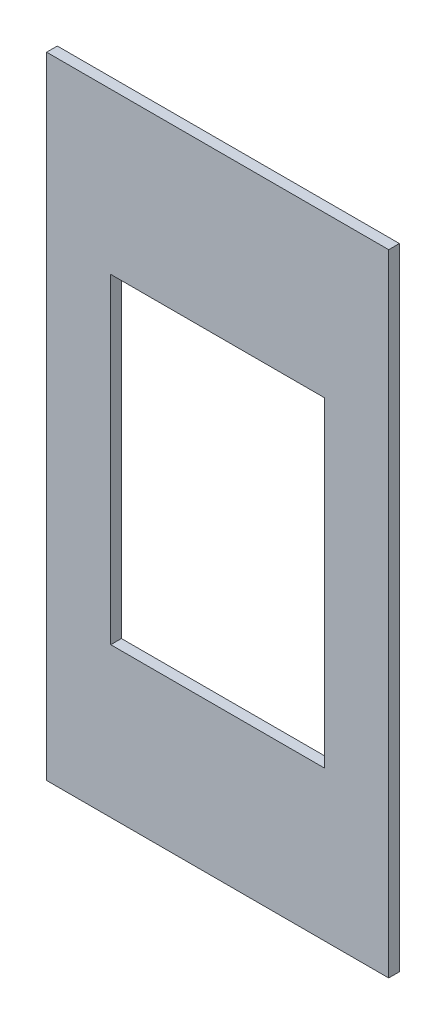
from build123d import *

# Parameters (mm, degrees)
SKETCH1_W      = 406.4
SKETCH1_H      = 749.3
SKETCH1_W_2    = 254
SKETCH1_H_2    = 381
EXTRUDE1_DEPTH = 12.7


with BuildPart() as part:
    # Sketch1 → Extrude1 (new body)
    with BuildSketch(Plane.XY):
        Rectangle(SKETCH1_W, SKETCH1_H)
        with Locations((0, -6.35)):
            Rectangle(SKETCH1_W_2, SKETCH1_H_2, mode=Mode.SUBTRACT)
    extrude(amount=EXTRUDE1_DEPTH)


solid = part.part
